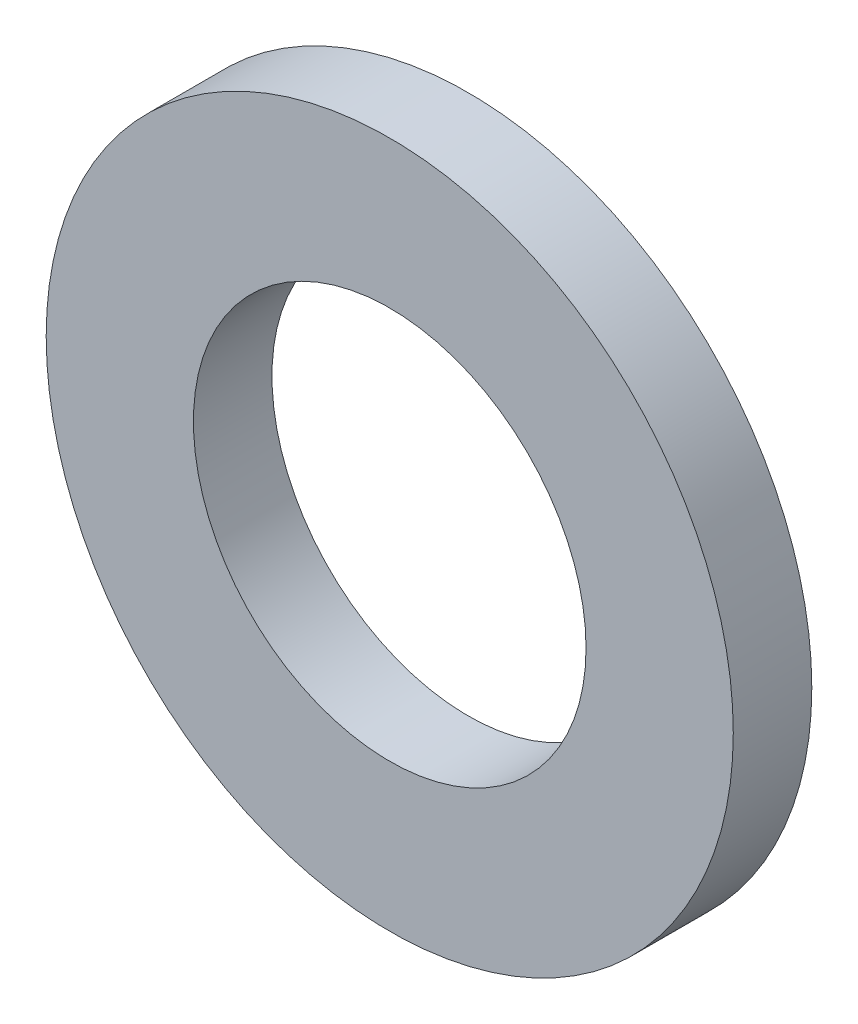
from build123d import *

# Parameters (mm, degrees)
ESQUISSE1_R          = 17.5
ESQUISSE1_R_2        = 10
BASE_EXTRUSION_DEPTH = 4


with BuildPart() as part:
    # Esquisse1 → Base-Extrusion (new body)
    with BuildSketch(Plane.XY):
        Circle(ESQUISSE1_R)
        Circle(ESQUISSE1_R_2, mode=Mode.SUBTRACT)
    extrude(amount=BASE_EXTRUSION_DEPTH)


solid = part.part
